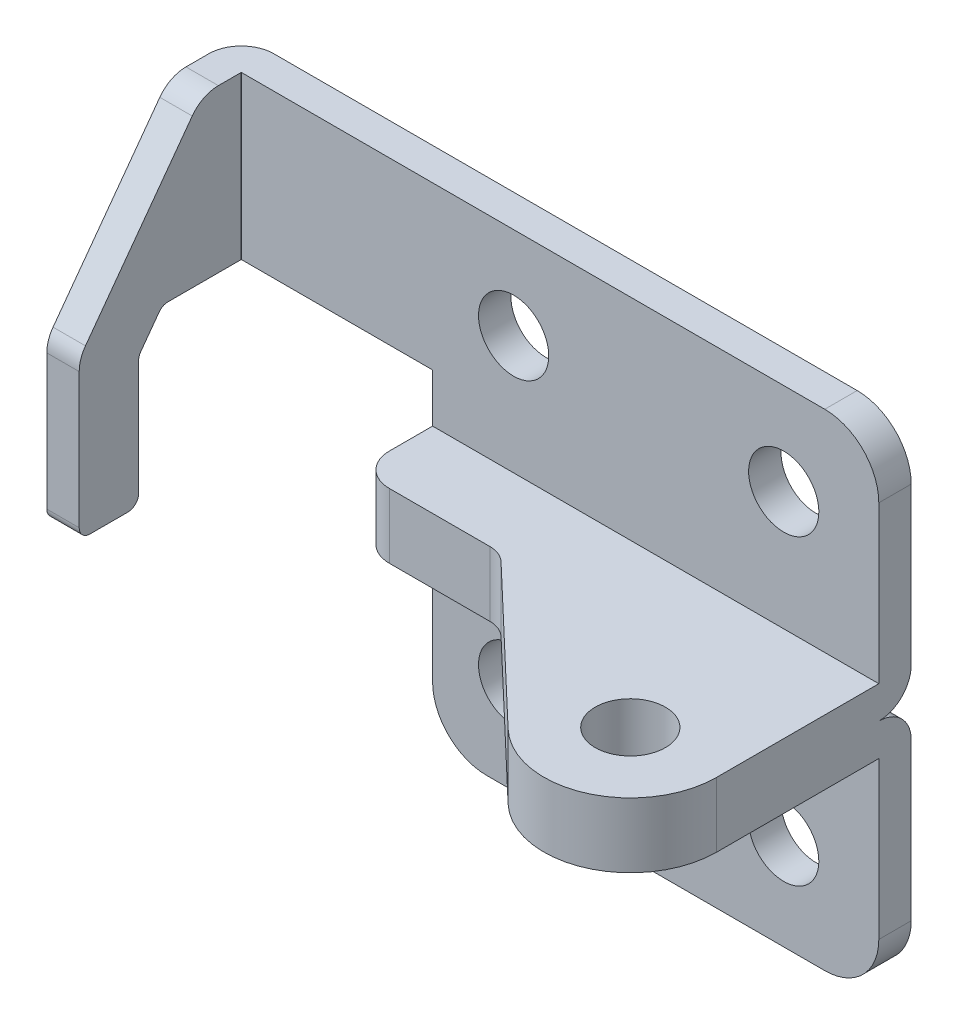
ISO-10303-21;
HEADER;
FILE_DESCRIPTION(('STEP AP214'),'2;1');
FILE_NAME('part.step','',(''),(''),'','','');
FILE_SCHEMA(('AUTOMOTIVE_DESIGN { 1 0 10303 214 1 1 1 1 }'));
ENDSEC;
DATA;
#1=APPLICATION_CONTEXT('core data for automotive mechanical design processes');
#2=APPLICATION_PROTOCOL_DEFINITION('international standard','automotive_design',2000,#1);
#3=PRODUCT_CONTEXT('',#1,'mechanical');
#4=PRODUCT('Part','Part','',(#3));
#5=PRODUCT_RELATED_PRODUCT_CATEGORY('part','',(#4));
#6=PRODUCT_DEFINITION_FORMATION('','',#4);
#7=PRODUCT_DEFINITION_CONTEXT('part definition',#1,'design');
#8=PRODUCT_DEFINITION('design','',#6,#7);
#9=PRODUCT_DEFINITION_SHAPE('','',#8);
#10=(LENGTH_UNIT() NAMED_UNIT(*) SI_UNIT(.MILLI.,.METRE.));
#11=(NAMED_UNIT(*) PLANE_ANGLE_UNIT() SI_UNIT($,.RADIAN.));
#12=(NAMED_UNIT(*) SI_UNIT($,.STERADIAN.) SOLID_ANGLE_UNIT());
#13=UNCERTAINTY_MEASURE_WITH_UNIT(LENGTH_MEASURE(1.E-05),#10,'distance_accuracy_value','');
#14=(GEOMETRIC_REPRESENTATION_CONTEXT(3) GLOBAL_UNCERTAINTY_ASSIGNED_CONTEXT((#13)) GLOBAL_UNIT_ASSIGNED_CONTEXT((#10,
#11,#12)) REPRESENTATION_CONTEXT('',''));
#15=CARTESIAN_POINT('',(0.,0.,0.));
#16=DIRECTION('',(0.,0.,1.));
#17=DIRECTION('',(1.,0.,0.));
#18=AXIS2_PLACEMENT_3D('',#15,#16,#17);
#19=CARTESIAN_POINT('',(-59.0040487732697,-6.50000000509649,35.860243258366));
#20=DIRECTION('',(-1.,0.,0.));
#21=DIRECTION('',(0.,-1.,0.));
#22=AXIS2_PLACEMENT_3D('',#19,#20,#21);
#23=CYLINDRICAL_SURFACE('',#22,1.);
#24=CARTESIAN_POINT('',(-62.0040487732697,-6.50000000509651,35.860243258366));
#25=DIRECTION('',(-1.,0.,0.));
#26=DIRECTION('',(0.,-1.,0.));
#27=AXIS2_PLACEMENT_3D('',#24,#25,#26);
#28=CIRCLE('',#27,1.);
#29=CARTESIAN_POINT('',(-62.0040487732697,-6.5000000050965,36.860243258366));
#30=VERTEX_POINT('',#29);
#31=CARTESIAN_POINT('',(-62.0040487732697,-7.50000000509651,35.860243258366));
#32=VERTEX_POINT('',#31);
#33=EDGE_CURVE('E231',#30,#32,#28,.F.);
#34=ORIENTED_EDGE('',*,*,#33,.T.);
#35=DIRECTION('',(-1.,0.,0.));
#36=VECTOR('',#35,1.);
#37=CARTESIAN_POINT('',(-59.0040487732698,-7.50000000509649,35.860243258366));
#38=LINE('',#37,#36);
#39=CARTESIAN_POINT('',(-59.0040487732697,-7.50000000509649,35.860243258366));
#40=VERTEX_POINT('',#39);
#41=EDGE_CURVE('E229',#32,#40,#38,.F.);
#42=ORIENTED_EDGE('',*,*,#41,.T.);
#43=CARTESIAN_POINT('',(-59.0040487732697,-6.50000000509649,35.860243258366));
#44=DIRECTION('',(-1.,0.,0.));
#45=DIRECTION('',(0.,-1.,0.));
#46=AXIS2_PLACEMENT_3D('',#43,#44,#45);
#47=CIRCLE('',#46,1.);
#48=CARTESIAN_POINT('',(-59.0040487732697,-6.50000000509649,36.860243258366));
#49=VERTEX_POINT('',#48);
#50=EDGE_CURVE('E17',#40,#49,#47,.T.);
#51=ORIENTED_EDGE('',*,*,#50,.T.);
#52=DIRECTION('',(-1.,0.,0.));
#53=VECTOR('',#52,1.);
#54=CARTESIAN_POINT('',(-59.0040487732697,-6.50000000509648,36.860243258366));
#55=LINE('',#54,#53);
#56=EDGE_CURVE('E226',#49,#30,#55,.T.);
#57=ORIENTED_EDGE('',*,*,#56,.T.);
#58=EDGE_LOOP('',(#34,#42,#51,#57));
#59=FACE_BOUND('',#58,.T.);
#60=ADVANCED_FACE('F14',(#59),#23,.T.);
#61=CARTESIAN_POINT('',(-59.0040487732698,-6.50000000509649,32.360243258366));
#62=DIRECTION('',(-1.,0.,0.));
#63=DIRECTION('',(0.,-1.,0.));
#64=AXIS2_PLACEMENT_3D('',#61,#62,#63);
#65=CYLINDRICAL_SURFACE('',#64,1.);
#66=CARTESIAN_POINT('',(-62.0040487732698,-6.50000000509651,32.360243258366));
#67=DIRECTION('',(-1.,0.,0.));
#68=DIRECTION('',(0.,-1.,0.));
#69=AXIS2_PLACEMENT_3D('',#66,#67,#68);
#70=CIRCLE('',#69,1.);
#71=CARTESIAN_POINT('',(-62.0040487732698,-7.50000000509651,32.360243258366));
#72=VERTEX_POINT('',#71);
#73=CARTESIAN_POINT('',(-62.0040487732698,-6.50000000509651,31.360243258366));
#74=VERTEX_POINT('',#73);
#75=EDGE_CURVE('E487',#72,#74,#70,.F.);
#76=ORIENTED_EDGE('',*,*,#75,.T.);
#77=DIRECTION('',(1.,0.,0.));
#78=VECTOR('',#77,1.);
#79=CARTESIAN_POINT('',(-59.0040487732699,-6.50000000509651,31.360243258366));
#80=LINE('',#79,#78);
#81=CARTESIAN_POINT('',(-59.0040487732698,-6.5000000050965,31.360243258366));
#82=VERTEX_POINT('',#81);
#83=EDGE_CURVE('E372',#74,#82,#80,.T.);
#84=ORIENTED_EDGE('',*,*,#83,.T.);
#85=CARTESIAN_POINT('',(-59.0040487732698,-6.50000000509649,32.360243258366));
#86=DIRECTION('',(-1.,0.,0.));
#87=DIRECTION('',(0.,-1.,0.));
#88=AXIS2_PLACEMENT_3D('',#85,#86,#87);
#89=CIRCLE('',#88,1.);
#90=CARTESIAN_POINT('',(-59.0040487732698,-7.50000000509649,32.360243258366));
#91=VERTEX_POINT('',#90);
#92=EDGE_CURVE('E489',#82,#91,#89,.T.);
#93=ORIENTED_EDGE('',*,*,#92,.T.);
#94=DIRECTION('',(-1.,0.,0.));
#95=VECTOR('',#94,1.);
#96=CARTESIAN_POINT('',(-59.0040487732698,-7.50000000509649,32.360243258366));
#97=LINE('',#96,#95);
#98=EDGE_CURVE('E375',#91,#72,#97,.T.);
#99=ORIENTED_EDGE('',*,*,#98,.T.);
#100=EDGE_LOOP('',(#76,#84,#93,#99));
#101=FACE_BOUND('',#100,.T.);
#102=ADVANCED_FACE('F943',(#101),#65,.T.);
#103=CARTESIAN_POINT('',(-59.0040487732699,4.17278437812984,30.3602432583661));
#104=DIRECTION('',(-1.,0.,0.));
#105=DIRECTION('',(0.,-1.,0.));
#106=AXIS2_PLACEMENT_3D('',#103,#104,#105);
#107=CYLINDRICAL_SURFACE('',#106,1.);
#108=CARTESIAN_POINT('',(-59.0040487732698,4.17278437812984,30.3602432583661));
#109=DIRECTION('',(-1.,0.,0.));
#110=DIRECTION('',(0.,-1.,0.));
#111=AXIS2_PLACEMENT_3D('',#108,#109,#110);
#112=CIRCLE('',#111,1.);
#113=CARTESIAN_POINT('',(-59.0040487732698,4.17278437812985,31.360243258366));
#114=VERTEX_POINT('',#113);
#115=CARTESIAN_POINT('',(-59.0040487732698,4.76392242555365,31.1668136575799));
#116=VERTEX_POINT('',#115);
#117=EDGE_CURVE('E400',#114,#116,#112,.T.);
#118=ORIENTED_EDGE('',*,*,#117,.F.);
#119=DIRECTION('',(1.,0.,0.));
#120=VECTOR('',#119,1.);
#121=CARTESIAN_POINT('',(-59.0040487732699,4.17278437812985,31.360243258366));
#122=LINE('',#121,#120);
#123=CARTESIAN_POINT('',(-62.0040487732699,4.17278437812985,31.360243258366));
#124=VERTEX_POINT('',#123);
#125=EDGE_CURVE('E371',#114,#124,#122,.F.);
#126=ORIENTED_EDGE('',*,*,#125,.T.);
#127=CARTESIAN_POINT('',(-62.0040487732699,4.17278437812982,30.3602432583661));
#128=DIRECTION('',(-1.,0.,0.));
#129=DIRECTION('',(0.,-1.,0.));
#130=AXIS2_PLACEMENT_3D('',#127,#128,#129);
#131=CIRCLE('',#130,1.);
#132=CARTESIAN_POINT('',(-62.0040487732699,4.76392242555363,31.1668136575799));
#133=VERTEX_POINT('',#132);
#134=EDGE_CURVE('E485',#133,#124,#131,.F.);
#135=ORIENTED_EDGE('',*,*,#134,.F.);
#136=DIRECTION('',(1.,0.,0.));
#137=VECTOR('',#136,1.);
#138=CARTESIAN_POINT('',(-59.0040487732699,4.76392242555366,31.1668136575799));
#139=LINE('',#138,#137);
#140=EDGE_CURVE('E367',#133,#116,#139,.T.);
#141=ORIENTED_EDGE('',*,*,#140,.T.);
#142=EDGE_LOOP('',(#118,#126,#135,#141));
#143=FACE_BOUND('',#142,.T.);
#144=ADVANCED_FACE('F521',(#143),#107,.F.);
#145=CARTESIAN_POINT('',(-28.99999999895,-1.01915004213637E-13,28.85619448));
#146=DIRECTION('',(0.,0.,-1.));
#147=DIRECTION('',(0.,1.,0.));
#148=AXIS2_PLACEMENT_3D('',#145,#146,#147);
#149=PLANE('',#148);
#150=DIRECTION('',(-1.,0.,0.));
#151=VECTOR('',#150,1.);
#152=CARTESIAN_POINT('',(-8.,3.00000000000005,28.85619448));
#153=LINE('',#152,#151);
#154=CARTESIAN_POINT('',(-38.3,2.99999999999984,28.85619448));
#155=VERTEX_POINT('',#154);
#156=CARTESIAN_POINT('',(-28.99999999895,2.9999999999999,28.85619448));
#157=VERTEX_POINT('',#156);
#158=EDGE_CURVE('E317',#155,#157,#153,.F.);
#159=ORIENTED_EDGE('',*,*,#158,.F.);
#160=DIRECTION('',(0.,-1.,0.));
#161=VECTOR('',#160,1.);
#162=CARTESIAN_POINT('',(-38.3,-1.66901031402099E-13,28.85619448));
#163=LINE('',#162,#161);
#164=CARTESIAN_POINT('',(-38.3,-3.00000000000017,28.85619448));
#165=VERTEX_POINT('',#164);
#166=EDGE_CURVE('E365',#165,#155,#163,.F.);
#167=ORIENTED_EDGE('',*,*,#166,.F.);
#168=DIRECTION('',(-1.,0.,0.));
#169=VECTOR('',#168,1.);
#170=CARTESIAN_POINT('',(-8.,-2.99999999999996,28.85619448));
#171=LINE('',#170,#169);
#172=CARTESIAN_POINT('',(-28.99999999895,-3.0000000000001,28.85619448));
#173=VERTEX_POINT('',#172);
#174=EDGE_CURVE('E327',#165,#173,#171,.F.);
#175=ORIENTED_EDGE('',*,*,#174,.T.);
#176=DIRECTION('',(0.,-1.,0.));
#177=VECTOR('',#176,1.);
#178=CARTESIAN_POINT('',(-28.99999999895,-1.01970090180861E-13,28.85619448));
#179=LINE('',#178,#177);
#180=EDGE_CURVE('E397',#173,#157,#179,.F.);
#181=ORIENTED_EDGE('',*,*,#180,.T.);
#182=EDGE_LOOP('',(#159,#167,#175,#181));
#183=FACE_BOUND('',#182,.T.);
#184=ADVANCED_FACE('F924',(#183),#149,.F.);
#185=CARTESIAN_POINT('',(-28.99999999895,0.,31.35619448));
#186=DIRECTION('',(0.,-1.,0.));
#187=DIRECTION('',(1.,0.,0.));
#188=AXIS2_PLACEMENT_3D('',#185,#186,#187);
#189=CYLINDRICAL_SURFACE('',#188,2.5);
#190=CARTESIAN_POINT('',(-28.99999999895,2.99999999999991,31.35619448));
#191=DIRECTION('',(0.,-1.,0.));
#192=DIRECTION('',(1.,0.,0.));
#193=AXIS2_PLACEMENT_3D('',#190,#191,#192);
#194=CIRCLE('',#193,2.5);
#195=CARTESIAN_POINT('',(-27.2758620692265,2.99999999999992,29.5458496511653));
#196=VERTEX_POINT('',#195);
#197=EDGE_CURVE('E316',#157,#196,#194,.T.);
#198=ORIENTED_EDGE('',*,*,#197,.F.);
#199=ORIENTED_EDGE('',*,*,#180,.F.);
#200=CARTESIAN_POINT('',(-28.99999999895,-3.00000000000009,31.35619448));
#201=DIRECTION('',(0.,-1.,0.));
#202=DIRECTION('',(1.,0.,0.));
#203=AXIS2_PLACEMENT_3D('',#200,#201,#202);
#204=CIRCLE('',#203,2.5);
#205=CARTESIAN_POINT('',(-27.2758620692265,-3.00000000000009,29.5458496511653));
#206=VERTEX_POINT('',#205);
#207=EDGE_CURVE('E326',#173,#206,#204,.T.);
#208=ORIENTED_EDGE('',*,*,#207,.T.);
#209=DIRECTION('',(0.,1.,0.));
#210=VECTOR('',#209,1.);
#211=CARTESIAN_POINT('',(-27.2758620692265,0.,29.5458496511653));
#212=LINE('',#211,#210);
#213=EDGE_CURVE('E384',#206,#196,#212,.T.);
#214=ORIENTED_EDGE('',*,*,#213,.T.);
#215=EDGE_LOOP('',(#198,#199,#208,#214));
#216=FACE_BOUND('',#215,.T.);
#217=ADVANCED_FACE('F914',(#216),#189,.F.);
#218=CARTESIAN_POINT('',(-13.5172413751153,0.,42.6492979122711));
#219=DIRECTION('',(0.689655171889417,0.,-0.724137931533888));
#220=DIRECTION('',(-0.724137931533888,0.,-0.689655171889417));
#221=AXIS2_PLACEMENT_3D('',#218,#219,#220);
#222=PLANE('',#221);
#223=DIRECTION('',(0.724137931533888,0.,0.689655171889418));
#224=VECTOR('',#223,1.);
#225=CARTESIAN_POINT('',(-27.2758620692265,2.99999999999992,29.5458496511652));
#226=LINE('',#225,#224);
#227=CARTESIAN_POINT('',(-13.5172413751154,3.00000000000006,42.6492979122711));
#228=VERTEX_POINT('',#227);
#229=EDGE_CURVE('E313',#196,#228,#226,.T.);
#230=ORIENTED_EDGE('',*,*,#229,.F.);
#231=ORIENTED_EDGE('',*,*,#213,.F.);
#232=DIRECTION('',(0.724137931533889,0.,0.689655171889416));
#233=VECTOR('',#232,1.);
#234=CARTESIAN_POINT('',(-27.2758620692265,-3.00000000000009,29.5458496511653));
#235=LINE('',#234,#233);
#236=CARTESIAN_POINT('',(-13.5172413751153,-2.99999999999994,42.6492979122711));
#237=VERTEX_POINT('',#236);
#238=EDGE_CURVE('E322',#206,#237,#235,.T.);
#239=ORIENTED_EDGE('',*,*,#238,.T.);
#240=DIRECTION('',(0.,-1.,0.));
#241=VECTOR('',#240,1.);
#242=CARTESIAN_POINT('',(-13.5172413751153,0.,42.6492979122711));
#243=LINE('',#242,#241);
#244=EDGE_CURVE('E402',#228,#237,#243,.T.);
#245=ORIENTED_EDGE('',*,*,#244,.F.);
#246=EDGE_LOOP('',(#230,#231,#239,#245));
#247=FACE_BOUND('',#246,.T.);
#248=ADVANCED_FACE('F904',(#247),#222,.F.);
#249=CARTESIAN_POINT('',(-8.,-2.99999999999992,36.85619446));
#250=DIRECTION('',(0.,-1.,0.));
#251=DIRECTION('',(1.,0.,0.));
#252=AXIS2_PLACEMENT_3D('',#249,#250,#251);
#253=CYLINDRICAL_SURFACE('',#252,3.25);
#254=CARTESIAN_POINT('',(-8.,-2.99999999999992,36.85619446));
#255=DIRECTION('',(0.,-1.,0.));
#256=DIRECTION('',(1.,0.,0.));
#257=AXIS2_PLACEMENT_3D('',#254,#255,#256);
#258=CIRCLE('',#257,3.25);
#259=CARTESIAN_POINT('',(-4.75,-2.9999999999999,36.85619446));
#260=VERTEX_POINT('',#259);
#261=EDGE_CURVE('E325',#260,#260,#258,.T.);
#262=ORIENTED_EDGE('',*,*,#261,.T.);
#263=EDGE_LOOP('',(#262));
#264=FACE_BOUND('',#263,.T.);
#265=CARTESIAN_POINT('',(-8.,3.00000000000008,36.85619446));
#266=DIRECTION('',(0.,-1.,0.));
#267=DIRECTION('',(1.,0.,0.));
#268=AXIS2_PLACEMENT_3D('',#265,#266,#267);
#269=CIRCLE('',#268,3.25);
#270=CARTESIAN_POINT('',(-4.75,3.0000000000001,36.85619446));
#271=VERTEX_POINT('',#270);
#272=EDGE_CURVE('E295',#271,#271,#269,.T.);
#273=ORIENTED_EDGE('',*,*,#272,.F.);
#274=EDGE_LOOP('',(#273));
#275=FACE_BOUND('',#274,.T.);
#276=ADVANCED_FACE('F894',(#264,#275),#253,.F.);
#277=CARTESIAN_POINT('',(-41.3,-22.4999999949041,18.8561944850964));
#278=DIRECTION('',(0.,1.,0.));
#279=DIRECTION('',(0.,0.,1.));
#280=AXIS2_PLACEMENT_3D('',#277,#278,#279);
#281=PLANE('',#280);
#282=DIRECTION('',(1.,0.,0.));
#283=VECTOR('',#282,1.);
#284=CARTESIAN_POINT('',(-8.0000000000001,-22.4999999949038,21.8561944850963));
#285=LINE('',#284,#283);
#286=CARTESIAN_POINT('',(-4.99999999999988,-22.4999999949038,21.8561944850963));
#287=VERTEX_POINT('',#286);
#288=CARTESIAN_POINT('',(-36.3,-22.4999999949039,21.8561944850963));
#289=VERTEX_POINT('',#288);
#290=EDGE_CURVE('E264',#287,#289,#285,.F.);
#291=ORIENTED_EDGE('',*,*,#290,.T.);
#292=DIRECTION('',(0.,0.,1.));
#293=VECTOR('',#292,1.);
#294=CARTESIAN_POINT('',(-36.3,-22.4999999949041,18.8561944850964));
#295=LINE('',#294,#293);
#296=CARTESIAN_POINT('',(-36.3,-22.499999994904,18.8561944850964));
#297=VERTEX_POINT('',#296);
#298=EDGE_CURVE('E390',#297,#289,#295,.T.);
#299=ORIENTED_EDGE('',*,*,#298,.F.);
#300=DIRECTION('',(1.,0.,0.));
#301=VECTOR('',#300,1.);
#302=CARTESIAN_POINT('',(-8.0000000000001,-22.4999999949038,18.8561944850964));
#303=LINE('',#302,#301);
#304=CARTESIAN_POINT('',(-4.99999999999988,-22.4999999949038,18.8561944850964));
#305=VERTEX_POINT('',#304);
#306=EDGE_CURVE('E292',#305,#297,#303,.F.);
#307=ORIENTED_EDGE('',*,*,#306,.F.);
#308=DIRECTION('',(0.,0.,1.));
#309=VECTOR('',#308,1.);
#310=CARTESIAN_POINT('',(-4.99999999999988,-22.4999999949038,18.8561944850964));
#311=LINE('',#310,#309);
#312=EDGE_CURVE('E392',#287,#305,#311,.F.);
#313=ORIENTED_EDGE('',*,*,#312,.F.);
#314=EDGE_LOOP('',(#291,#299,#307,#313));
#315=FACE_BOUND('',#314,.T.);
#316=ADVANCED_FACE('F884',(#315),#281,.F.);
#317=CARTESIAN_POINT('',(-8.7999999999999,-13.9999999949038,18.8561944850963));
#318=DIRECTION('',(0.,0.,-1.));
#319=DIRECTION('',(0.,1.,0.));
#320=AXIS2_PLACEMENT_3D('',#317,#318,#319);
#321=CYLINDRICAL_SURFACE('',#320,3.25);
#322=CARTESIAN_POINT('',(-8.7999999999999,-13.9999999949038,21.8561944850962));
#323=DIRECTION('',(0.,0.,-1.));
#324=DIRECTION('',(0.,1.,0.));
#325=AXIS2_PLACEMENT_3D('',#322,#323,#324);
#326=CIRCLE('',#325,3.25);
#327=CARTESIAN_POINT('',(-8.7999999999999,-10.7499999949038,21.8561944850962));
#328=VERTEX_POINT('',#327);
#329=EDGE_CURVE('E456',#328,#328,#326,.F.);
#330=ORIENTED_EDGE('',*,*,#329,.T.);
#331=EDGE_LOOP('',(#330));
#332=FACE_BOUND('',#331,.T.);
#333=CARTESIAN_POINT('',(-8.7999999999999,-13.9999999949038,18.8561944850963));
#334=DIRECTION('',(0.,0.,-1.));
#335=DIRECTION('',(0.,1.,0.));
#336=AXIS2_PLACEMENT_3D('',#333,#334,#335);
#337=CIRCLE('',#336,3.25);
#338=CARTESIAN_POINT('',(-8.7999999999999,-10.7499999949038,18.8561944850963));
#339=VERTEX_POINT('',#338);
#340=EDGE_CURVE('E298',#339,#339,#337,.F.);
#341=ORIENTED_EDGE('',*,*,#340,.F.);
#342=EDGE_LOOP('',(#341));
#343=FACE_BOUND('',#342,.T.);
#344=ADVANCED_FACE('F874',(#332,#343),#321,.F.);
#345=CARTESIAN_POINT('',(-33.8,-13.999999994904,18.8561944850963));
#346=DIRECTION('',(0.,0.,-1.));
#347=DIRECTION('',(0.,1.,0.));
#348=AXIS2_PLACEMENT_3D('',#345,#346,#347);
#349=CYLINDRICAL_SURFACE('',#348,3.25);
#350=CARTESIAN_POINT('',(-33.8,-13.999999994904,21.8561944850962));
#351=DIRECTION('',(0.,0.,-1.));
#352=DIRECTION('',(0.,1.,0.));
#353=AXIS2_PLACEMENT_3D('',#350,#351,#352);
#354=CIRCLE('',#353,3.25);
#355=CARTESIAN_POINT('',(-33.8,-10.749999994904,21.8561944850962));
#356=VERTEX_POINT('',#355);
#357=EDGE_CURVE('E453',#356,#356,#354,.F.);
#358=ORIENTED_EDGE('',*,*,#357,.T.);
#359=EDGE_LOOP('',(#358));
#360=FACE_BOUND('',#359,.T.);
#361=CARTESIAN_POINT('',(-33.8,-13.999999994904,18.8561944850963));
#362=DIRECTION('',(0.,0.,-1.));
#363=DIRECTION('',(0.,1.,0.));
#364=AXIS2_PLACEMENT_3D('',#361,#362,#363);
#365=CIRCLE('',#364,3.25);
#366=CARTESIAN_POINT('',(-33.8,-10.749999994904,18.8561944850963));
#367=VERTEX_POINT('',#366);
#368=EDGE_CURVE('E394',#367,#367,#365,.F.);
#369=ORIENTED_EDGE('',*,*,#368,.F.);
#370=EDGE_LOOP('',(#369));
#371=FACE_BOUND('',#370,.T.);
#372=ADVANCED_FACE('F610',(#360,#371),#349,.F.);
#373=CARTESIAN_POINT('',(-59.0040487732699,7.79176728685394,36.2799544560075));
#374=DIRECTION('',(0.,-0.591138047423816,-0.806570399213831));
#375=DIRECTION('',(0.,0.806570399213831,-0.591138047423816));
#376=AXIS2_PLACEMENT_3D('',#373,#374,#375);
#377=PLANE('',#376);
#378=DIRECTION('',(0.,-0.806570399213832,0.591138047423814));
#379=VECTOR('',#378,1.);
#380=CARTESIAN_POINT('',(-59.00404877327,21.273414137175,26.3992119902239));
#381=LINE('',#380,#379);
#382=CARTESIAN_POINT('',(-59.00404877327,21.273414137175,26.3992119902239));
#383=VERTEX_POINT('',#382);
#384=CARTESIAN_POINT('',(-59.0040487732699,7.79176728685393,36.2799544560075));
#385=VERTEX_POINT('',#384);
#386=EDGE_CURVE('E248',#383,#385,#381,.T.);
#387=ORIENTED_EDGE('',*,*,#386,.F.);
#388=DIRECTION('',(-1.,0.,0.));
#389=VECTOR('',#388,1.);
#390=CARTESIAN_POINT('',(-59.00404877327,21.273414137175,26.3992119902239));
#391=LINE('',#390,#389);
#392=CARTESIAN_POINT('',(-62.00404877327,21.2734141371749,26.3992119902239));
#393=VERTEX_POINT('',#392);
#394=EDGE_CURVE('E385',#393,#383,#391,.F.);
#395=ORIENTED_EDGE('',*,*,#394,.F.);
#396=DIRECTION('',(0.,-0.80657039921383,0.591138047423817));
#397=VECTOR('',#396,1.);
#398=CARTESIAN_POINT('',(-62.00404877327,21.2734141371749,26.3992119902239));
#399=LINE('',#398,#397);
#400=CARTESIAN_POINT('',(-62.0040487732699,7.79176728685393,36.2799544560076));
#401=VERTEX_POINT('',#400);
#402=EDGE_CURVE('E447',#393,#401,#399,.T.);
#403=ORIENTED_EDGE('',*,*,#402,.T.);
#404=DIRECTION('',(-1.,0.,0.));
#405=VECTOR('',#404,1.);
#406=CARTESIAN_POINT('',(-59.0040487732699,7.79176728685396,36.2799544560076));
#407=LINE('',#406,#405);
#408=EDGE_CURVE('E381',#385,#401,#407,.T.);
#409=ORIENTED_EDGE('',*,*,#408,.F.);
#410=EDGE_LOOP('',(#387,#395,#403,#409));
#411=FACE_BOUND('',#410,.T.);
#412=ADVANCED_FACE('F597',(#411),#377,.F.);
#413=CARTESIAN_POINT('',(-59.0040487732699,6.01835314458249,33.860243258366));
#414=DIRECTION('',(-1.,0.,0.));
#415=DIRECTION('',(0.,-1.,0.));
#416=AXIS2_PLACEMENT_3D('',#413,#414,#415);
#417=CYLINDRICAL_SURFACE('',#416,3.);
#418=CARTESIAN_POINT('',(-62.0040487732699,6.01835314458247,33.860243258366));
#419=DIRECTION('',(-1.,0.,0.));
#420=DIRECTION('',(0.,-1.,0.));
#421=AXIS2_PLACEMENT_3D('',#418,#419,#420);
#422=CIRCLE('',#421,3.);
#423=CARTESIAN_POINT('',(-62.0040487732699,6.01835314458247,36.860243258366));
#424=VERTEX_POINT('',#423);
#425=EDGE_CURVE('E444',#401,#424,#422,.F.);
#426=ORIENTED_EDGE('',*,*,#425,.T.);
#427=DIRECTION('',(-1.,0.,0.));
#428=VECTOR('',#427,1.);
#429=CARTESIAN_POINT('',(-59.0040487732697,6.01835314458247,36.860243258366));
#430=LINE('',#429,#428);
#431=CARTESIAN_POINT('',(-59.0040487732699,6.01835314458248,36.860243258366));
#432=VERTEX_POINT('',#431);
#433=EDGE_CURVE('E238',#424,#432,#430,.F.);
#434=ORIENTED_EDGE('',*,*,#433,.T.);
#435=CARTESIAN_POINT('',(-59.0040487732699,6.01835314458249,33.860243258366));
#436=DIRECTION('',(-1.,0.,0.));
#437=DIRECTION('',(0.,-1.,0.));
#438=AXIS2_PLACEMENT_3D('',#435,#436,#437);
#439=CIRCLE('',#438,3.);
#440=EDGE_CURVE('E242',#385,#432,#439,.F.);
#441=ORIENTED_EDGE('',*,*,#440,.F.);
#442=ORIENTED_EDGE('',*,*,#408,.T.);
#443=EDGE_LOOP('',(#426,#434,#441,#442));
#444=FACE_BOUND('',#443,.T.);
#445=ADVANCED_FACE('F600',(#444),#417,.T.);
#446=CARTESIAN_POINT('',(-59.0040487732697,-6.50000000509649,36.860243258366));
#447=DIRECTION('',(0.,0.,-1.));
#448=DIRECTION('',(-1.,0.,0.));
#449=AXIS2_PLACEMENT_3D('',#446,#447,#448);
#450=PLANE('',#449);
#451=DIRECTION('',(0.,1.,0.));
#452=VECTOR('',#451,1.);
#453=CARTESIAN_POINT('',(-59.0040487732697,-14.3561944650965,36.860243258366));
#454=LINE('',#453,#452);
#455=EDGE_CURVE('E235',#432,#49,#454,.F.);
#456=ORIENTED_EDGE('',*,*,#455,.F.);
#457=ORIENTED_EDGE('',*,*,#433,.F.);
#458=DIRECTION('',(0.,1.,0.));
#459=VECTOR('',#458,1.);
#460=CARTESIAN_POINT('',(-62.0040487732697,-14.3561944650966,36.860243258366));
#461=LINE('',#460,#459);
#462=EDGE_CURVE('E237',#424,#30,#461,.F.);
#463=ORIENTED_EDGE('',*,*,#462,.T.);
#464=ORIENTED_EDGE('',*,*,#56,.F.);
#465=EDGE_LOOP('',(#456,#457,#463,#464));
#466=FACE_BOUND('',#465,.T.);
#467=ADVANCED_FACE('F234',(#466),#450,.F.);
#468=CARTESIAN_POINT('',(-59.0040487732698,-7.50000000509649,32.360243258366));
#469=DIRECTION('',(0.,1.,0.));
#470=DIRECTION('',(-1.,0.,0.));
#471=AXIS2_PLACEMENT_3D('',#468,#469,#470);
#472=PLANE('',#471);
#473=DIRECTION('',(0.,0.,1.));
#474=VECTOR('',#473,1.);
#475=CARTESIAN_POINT('',(-59.00404877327,-7.50000000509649,-31.499756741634));
#476=LINE('',#475,#474);
#477=EDGE_CURVE('E244',#40,#91,#476,.F.);
#478=ORIENTED_EDGE('',*,*,#477,.F.);
#479=ORIENTED_EDGE('',*,*,#41,.F.);
#480=DIRECTION('',(0.,0.,1.));
#481=VECTOR('',#480,1.);
#482=CARTESIAN_POINT('',(-62.00404877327,-7.50000000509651,-31.499756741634));
#483=LINE('',#482,#481);
#484=EDGE_CURVE('E496',#32,#72,#483,.F.);
#485=ORIENTED_EDGE('',*,*,#484,.T.);
#486=ORIENTED_EDGE('',*,*,#98,.F.);
#487=EDGE_LOOP('',(#478,#479,#485,#486));
#488=FACE_BOUND('',#487,.T.);
#489=ADVANCED_FACE('F494',(#488),#472,.F.);
#490=CARTESIAN_POINT('',(-59.0040487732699,4.17278437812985,31.360243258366));
#491=DIRECTION('',(0.,0.,1.));
#492=DIRECTION('',(0.,-1.,0.));
#493=AXIS2_PLACEMENT_3D('',#490,#491,#492);
#494=PLANE('',#493);
#495=DIRECTION('',(0.,1.,0.));
#496=VECTOR('',#495,1.);
#497=CARTESIAN_POINT('',(-59.0040487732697,-14.3561944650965,31.360243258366));
#498=LINE('',#497,#496);
#499=EDGE_CURVE('E246',#82,#114,#498,.T.);
#500=ORIENTED_EDGE('',*,*,#499,.F.);
#501=ORIENTED_EDGE('',*,*,#83,.F.);
#502=DIRECTION('',(0.,1.,0.));
#503=VECTOR('',#502,1.);
#504=CARTESIAN_POINT('',(-62.0040487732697,-14.3561944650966,31.360243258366));
#505=LINE('',#504,#503);
#506=EDGE_CURVE('E500',#74,#124,#505,.T.);
#507=ORIENTED_EDGE('',*,*,#506,.T.);
#508=ORIENTED_EDGE('',*,*,#125,.F.);
#509=EDGE_LOOP('',(#500,#501,#507,#508));
#510=FACE_BOUND('',#509,.T.);
#511=ADVANCED_FACE('F519',(#510),#494,.F.);
#512=CARTESIAN_POINT('',(-59.0040487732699,7.09113804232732,29.4611898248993));
#513=DIRECTION('',(0.,0.591138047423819,0.806570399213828));
#514=DIRECTION('',(0.,-0.806570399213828,0.591138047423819));
#515=AXIS2_PLACEMENT_3D('',#512,#513,#514);
#516=PLANE('',#515);
#517=DIRECTION('',(0.,0.806570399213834,-0.591138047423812));
#518=VECTOR('',#517,1.);
#519=CARTESIAN_POINT('',(-59.0040487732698,4.76392242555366,31.1668136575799));
#520=LINE('',#519,#518);
#521=CARTESIAN_POINT('',(-59.0040487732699,7.09113804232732,29.4611898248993));
#522=VERTEX_POINT('',#521);
#523=EDGE_CURVE('E450',#116,#522,#520,.T.);
#524=ORIENTED_EDGE('',*,*,#523,.F.);
#525=ORIENTED_EDGE('',*,*,#140,.F.);
#526=DIRECTION('',(0.,0.806570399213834,-0.591138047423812));
#527=VECTOR('',#526,1.);
#528=CARTESIAN_POINT('',(-62.0040487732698,4.76392242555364,31.1668136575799));
#529=LINE('',#528,#527);
#530=CARTESIAN_POINT('',(-62.0040487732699,7.0911380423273,29.4611898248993));
#531=VERTEX_POINT('',#530);
#532=EDGE_CURVE('E443',#133,#531,#529,.T.);
#533=ORIENTED_EDGE('',*,*,#532,.T.);
#534=DIRECTION('',(-1.,0.,0.));
#535=VECTOR('',#534,1.);
#536=CARTESIAN_POINT('',(-59.0040487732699,7.09113804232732,29.4611898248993));
#537=LINE('',#536,#535);
#538=EDGE_CURVE('E363',#531,#522,#537,.F.);
#539=ORIENTED_EDGE('',*,*,#538,.T.);
#540=EDGE_LOOP('',(#524,#525,#533,#539));
#541=FACE_BOUND('',#540,.T.);
#542=ADVANCED_FACE('F527',(#541),#516,.F.);
#543=CARTESIAN_POINT('',(-58.9940487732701,30.4798553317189,21.8661944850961));
#544=DIRECTION('',(0.,-1.,0.));
#545=DIRECTION('',(1.,0.,0.));
#546=AXIS2_PLACEMENT_3D('',#543,#544,#545);
#547=CYLINDRICAL_SURFACE('',#546,0.00999999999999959);
#548=DIRECTION('',(0.,1.,0.));
#549=VECTOR('',#548,1.);
#550=CARTESIAN_POINT('',(-58.99404877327,-14.3561944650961,21.8561944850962));
#551=LINE('',#550,#549);
#552=CARTESIAN_POINT('',(-58.99404877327,22.4999999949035,21.8561944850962));
#553=VERTEX_POINT('',#552);
#554=CARTESIAN_POINT('',(-58.99404877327,7.4999999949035,21.8561944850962));
#555=VERTEX_POINT('',#554);
#556=EDGE_CURVE('E306',#553,#555,#551,.F.);
#557=ORIENTED_EDGE('',*,*,#556,.F.);
#558=CARTESIAN_POINT('',(-58.99404877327,22.4999999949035,21.8661944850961));
#559=DIRECTION('',(0.,-1.,0.));
#560=DIRECTION('',(1.,0.,0.));
#561=AXIS2_PLACEMENT_3D('',#558,#559,#560);
#562=CIRCLE('',#561,0.00999999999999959);
#563=CARTESIAN_POINT('',(-59.00404877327,22.4999999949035,21.8661944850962));
#564=VERTEX_POINT('',#563);
#565=EDGE_CURVE('E370',#564,#553,#562,.T.);
#566=ORIENTED_EDGE('',*,*,#565,.F.);
#567=DIRECTION('',(0.,1.,0.));
#568=VECTOR('',#567,1.);
#569=CARTESIAN_POINT('',(-59.0040487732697,-14.3561944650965,21.8661944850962));
#570=LINE('',#569,#568);
#571=CARTESIAN_POINT('',(-59.0040487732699,7.4999999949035,21.8661944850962));
#572=VERTEX_POINT('',#571);
#573=EDGE_CURVE('E253',#572,#564,#570,.T.);
#574=ORIENTED_EDGE('',*,*,#573,.F.);
#575=CARTESIAN_POINT('',(-58.9940487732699,7.4999999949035,21.8661944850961));
#576=DIRECTION('',(0.,-1.,0.));
#577=DIRECTION('',(1.,0.,0.));
#578=AXIS2_PLACEMENT_3D('',#575,#576,#577);
#579=CIRCLE('',#578,0.00999999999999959);
#580=EDGE_CURVE('E366',#555,#572,#579,.F.);
#581=ORIENTED_EDGE('',*,*,#580,.F.);
#582=EDGE_LOOP('',(#557,#566,#574,#581));
#583=FACE_BOUND('',#582,.T.);
#584=ADVANCED_FACE('F700',(#583),#547,.F.);
#585=CARTESIAN_POINT('',(-59.0040487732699,6.49999999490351,28.6546194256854));
#586=DIRECTION('',(-1.,0.,0.));
#587=DIRECTION('',(0.,-1.,0.));
#588=AXIS2_PLACEMENT_3D('',#585,#586,#587);
#589=CYLINDRICAL_SURFACE('',#588,1.);
#590=CARTESIAN_POINT('',(-59.0040487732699,6.49999999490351,28.6546194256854));
#591=DIRECTION('',(-1.,0.,0.));
#592=DIRECTION('',(0.,-1.,0.));
#593=AXIS2_PLACEMENT_3D('',#590,#591,#592);
#594=CIRCLE('',#593,1.);
#595=CARTESIAN_POINT('',(-59.0040487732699,7.4999999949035,28.6546194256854));
#596=VERTEX_POINT('',#595);
#597=EDGE_CURVE('E256',#522,#596,#594,.T.);
#598=ORIENTED_EDGE('',*,*,#597,.F.);
#599=ORIENTED_EDGE('',*,*,#538,.F.);
#600=CARTESIAN_POINT('',(-62.0040487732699,6.49999999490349,28.6546194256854));
#601=DIRECTION('',(-1.,0.,0.));
#602=DIRECTION('',(0.,-1.,0.));
#603=AXIS2_PLACEMENT_3D('',#600,#601,#602);
#604=CIRCLE('',#603,1.);
#605=CARTESIAN_POINT('',(-62.0040487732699,7.49999999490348,28.6546194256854));
#606=VERTEX_POINT('',#605);
#607=EDGE_CURVE('E441',#531,#606,#604,.T.);
#608=ORIENTED_EDGE('',*,*,#607,.T.);
#609=DIRECTION('',(-1.,0.,0.));
#610=VECTOR('',#609,1.);
#611=CARTESIAN_POINT('',(-41.3,7.49999999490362,28.6546194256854));
#612=LINE('',#611,#610);
#613=EDGE_CURVE('E358',#606,#596,#612,.F.);
#614=ORIENTED_EDGE('',*,*,#613,.T.);
#615=EDGE_LOOP('',(#598,#599,#608,#614));
#616=FACE_BOUND('',#615,.T.);
#617=ADVANCED_FACE('F532',(#616),#589,.F.);
#618=CARTESIAN_POINT('',(-38.3,-1.77375475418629E-13,25.85619448));
#619=DIRECTION('',(0.,-1.,0.));
#620=DIRECTION('',(1.,0.,0.));
#621=AXIS2_PLACEMENT_3D('',#618,#619,#620);
#622=CYLINDRICAL_SURFACE('',#621,3.);
#623=DIRECTION('',(0.,1.,0.));
#624=VECTOR('',#623,1.);
#625=CARTESIAN_POINT('',(-41.3,3.35619448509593,25.85619448));
#626=LINE('',#625,#624);
#627=CARTESIAN_POINT('',(-41.3,2.99999999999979,25.85619448));
#628=VERTEX_POINT('',#627);
#629=CARTESIAN_POINT('',(-41.3,-3.0000000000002,25.85619448));
#630=VERTEX_POINT('',#629);
#631=EDGE_CURVE('E342',#628,#630,#626,.F.);
#632=ORIENTED_EDGE('',*,*,#631,.T.);
#633=CARTESIAN_POINT('',(-38.3,-3.00000000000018,25.85619448));
#634=DIRECTION('',(0.,-1.,0.));
#635=DIRECTION('',(1.,0.,0.));
#636=AXIS2_PLACEMENT_3D('',#633,#634,#635);
#637=CIRCLE('',#636,3.);
#638=EDGE_CURVE('E330',#630,#165,#637,.F.);
#639=ORIENTED_EDGE('',*,*,#638,.T.);
#640=ORIENTED_EDGE('',*,*,#166,.T.);
#641=CARTESIAN_POINT('',(-38.3,2.99999999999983,25.85619448));
#642=DIRECTION('',(0.,-1.,0.));
#643=DIRECTION('',(1.,0.,0.));
#644=AXIS2_PLACEMENT_3D('',#641,#642,#643);
#645=CIRCLE('',#644,3.);
#646=EDGE_CURVE('E319',#628,#155,#645,.F.);
#647=ORIENTED_EDGE('',*,*,#646,.F.);
#648=EDGE_LOOP('',(#632,#639,#640,#647));
#649=FACE_BOUND('',#648,.T.);
#650=ADVANCED_FACE('F693',(#649),#622,.T.);
#651=CARTESIAN_POINT('',(-36.3,-17.4999999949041,18.8561944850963));
#652=DIRECTION('',(0.,0.,1.));
#653=DIRECTION('',(0.,-1.,0.));
#654=AXIS2_PLACEMENT_3D('',#651,#652,#653);
#655=CYLINDRICAL_SURFACE('',#654,5.);
#656=CARTESIAN_POINT('',(-36.3,-17.4999999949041,18.8561944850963));
#657=DIRECTION('',(0.,0.,1.));
#658=DIRECTION('',(0.,-1.,0.));
#659=AXIS2_PLACEMENT_3D('',#656,#657,#658);
#660=CIRCLE('',#659,5.);
#661=CARTESIAN_POINT('',(-41.3,-17.4999999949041,18.8561944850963));
#662=VERTEX_POINT('',#661);
#663=EDGE_CURVE('E294',#297,#662,#660,.F.);
#664=ORIENTED_EDGE('',*,*,#663,.F.);
#665=ORIENTED_EDGE('',*,*,#298,.T.);
#666=CARTESIAN_POINT('',(-36.3,-17.4999999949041,21.8561944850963));
#667=DIRECTION('',(0.,0.,1.));
#668=DIRECTION('',(0.,-1.,0.));
#669=AXIS2_PLACEMENT_3D('',#666,#667,#668);
#670=CIRCLE('',#669,5.);
#671=CARTESIAN_POINT('',(-41.3,-17.4999999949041,21.8561944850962));
#672=VERTEX_POINT('',#671);
#673=EDGE_CURVE('E267',#289,#672,#670,.F.);
#674=ORIENTED_EDGE('',*,*,#673,.T.);
#675=DIRECTION('',(0.,0.,1.));
#676=VECTOR('',#675,1.);
#677=CARTESIAN_POINT('',(-41.3,-17.4999999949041,18.8561944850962));
#678=LINE('',#677,#676);
#679=EDGE_CURVE('E331',#672,#662,#678,.F.);
#680=ORIENTED_EDGE('',*,*,#679,.T.);
#681=EDGE_LOOP('',(#664,#665,#674,#680));
#682=FACE_BOUND('',#681,.T.);
#683=ADVANCED_FACE('F689',(#682),#655,.T.);
#684=CARTESIAN_POINT('',(-8.,-2.99999999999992,36.85619446));
#685=DIRECTION('',(0.,1.,0.));
#686=DIRECTION('',(-1.,0.,0.));
#687=AXIS2_PLACEMENT_3D('',#684,#685,#686);
#688=PLANE('',#687);
#689=ORIENTED_EDGE('',*,*,#261,.F.);
#690=EDGE_LOOP('',(#689));
#691=FACE_BOUND('',#690,.T.);
#692=DIRECTION('',(0.,0.,1.));
#693=VECTOR('',#692,1.);
#694=CARTESIAN_POINT('',(0.,-2.99999999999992,18.8561944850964));
#695=LINE('',#694,#693);
#696=CARTESIAN_POINT('',(0.,-3.,21.8561944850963));
#697=VERTEX_POINT('',#696);
#698=CARTESIAN_POINT('',(0.,-2.9999999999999,36.85619446));
#699=VERTEX_POINT('',#698);
#700=EDGE_CURVE('E285',#697,#699,#695,.T.);
#701=ORIENTED_EDGE('',*,*,#700,.T.);
#702=CARTESIAN_POINT('',(-8.,-2.99999999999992,36.85619446));
#703=DIRECTION('',(0.,-1.,0.));
#704=DIRECTION('',(1.,0.,0.));
#705=AXIS2_PLACEMENT_3D('',#702,#703,#704);
#706=CIRCLE('',#705,8.);
#707=EDGE_CURVE('E404',#237,#699,#706,.F.);
#708=ORIENTED_EDGE('',*,*,#707,.F.);
#709=ORIENTED_EDGE('',*,*,#238,.F.);
#710=ORIENTED_EDGE('',*,*,#207,.F.);
#711=ORIENTED_EDGE('',*,*,#174,.F.);
#712=ORIENTED_EDGE('',*,*,#638,.F.);
#713=DIRECTION('',(0.,0.,1.));
#714=VECTOR('',#713,1.);
#715=CARTESIAN_POINT('',(-41.3,-3.0000000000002,18.8561944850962));
#716=LINE('',#715,#714);
#717=CARTESIAN_POINT('',(-41.3,-3.00000000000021,21.8561944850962));
#718=VERTEX_POINT('',#717);
#719=EDGE_CURVE('E337',#630,#718,#716,.F.);
#720=ORIENTED_EDGE('',*,*,#719,.T.);
#721=DIRECTION('',(1.,0.,0.));
#722=VECTOR('',#721,1.);
#723=CARTESIAN_POINT('',(-8.0000000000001,-3.00000000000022,21.8561944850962));
#724=LINE('',#723,#722);
#725=EDGE_CURVE('E279',#718,#697,#724,.T.);
#726=ORIENTED_EDGE('',*,*,#725,.T.);
#727=EDGE_LOOP('',(#701,#708,#709,#710,#711,#712,#720,#726));
#728=FACE_BOUND('',#727,.T.);
#729=ADVANCED_FACE('F685',(#691,#728),#688,.F.);
#730=CARTESIAN_POINT('',(-8.,0.,36.85619446));
#731=DIRECTION('',(0.,-1.,0.));
#732=DIRECTION('',(1.,0.,0.));
#733=AXIS2_PLACEMENT_3D('',#730,#731,#732);
#734=CYLINDRICAL_SURFACE('',#733,8.);
#735=ORIENTED_EDGE('',*,*,#244,.T.);
#736=ORIENTED_EDGE('',*,*,#707,.T.);
#737=DIRECTION('',(0.,-1.,0.));
#738=VECTOR('',#737,1.);
#739=CARTESIAN_POINT('',(1.57116660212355E-13,-22.4999999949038,36.85619446));
#740=LINE('',#739,#738);
#741=CARTESIAN_POINT('',(0.,3.00000000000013,36.85619446));
#742=VERTEX_POINT('',#741);
#743=EDGE_CURVE('E288',#699,#742,#740,.F.);
#744=ORIENTED_EDGE('',*,*,#743,.T.);
#745=CARTESIAN_POINT('',(-8.,3.00000000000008,36.85619446));
#746=DIRECTION('',(0.,-1.,0.));
#747=DIRECTION('',(1.,0.,0.));
#748=AXIS2_PLACEMENT_3D('',#745,#746,#747);
#749=CIRCLE('',#748,8.);
#750=EDGE_CURVE('E473',#228,#742,#749,.F.);
#751=ORIENTED_EDGE('',*,*,#750,.F.);
#752=EDGE_LOOP('',(#735,#736,#744,#751));
#753=FACE_BOUND('',#752,.T.);
#754=ADVANCED_FACE('F681',(#753),#734,.T.);
#755=CARTESIAN_POINT('',(-8.,3.00000000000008,36.85619446));
#756=DIRECTION('',(0.,1.,0.));
#757=DIRECTION('',(-1.,0.,0.));
#758=AXIS2_PLACEMENT_3D('',#755,#756,#757);
#759=PLANE('',#758);
#760=ORIENTED_EDGE('',*,*,#272,.T.);
#761=EDGE_LOOP('',(#760));
#762=FACE_BOUND('',#761,.T.);
#763=ORIENTED_EDGE('',*,*,#197,.T.);
#764=ORIENTED_EDGE('',*,*,#229,.T.);
#765=ORIENTED_EDGE('',*,*,#750,.T.);
#766=DIRECTION('',(0.,0.,1.));
#767=VECTOR('',#766,1.);
#768=CARTESIAN_POINT('',(0.,3.00000000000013,18.8561944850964));
#769=LINE('',#768,#767);
#770=CARTESIAN_POINT('',(0.,3.,21.8561944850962));
#771=VERTEX_POINT('',#770);
#772=EDGE_CURVE('E261',#742,#771,#769,.F.);
#773=ORIENTED_EDGE('',*,*,#772,.T.);
#774=DIRECTION('',(1.,0.,0.));
#775=VECTOR('',#774,1.);
#776=CARTESIAN_POINT('',(-7.9999999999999,2.99999999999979,21.8561944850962));
#777=LINE('',#776,#775);
#778=CARTESIAN_POINT('',(-41.3,2.99999999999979,21.8561944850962));
#779=VERTEX_POINT('',#778);
#780=EDGE_CURVE('E302',#779,#771,#777,.T.);
#781=ORIENTED_EDGE('',*,*,#780,.F.);
#782=DIRECTION('',(0.,0.,1.));
#783=VECTOR('',#782,1.);
#784=CARTESIAN_POINT('',(-41.3,2.99999999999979,18.8561944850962));
#785=LINE('',#784,#783);
#786=EDGE_CURVE('E347',#779,#628,#785,.T.);
#787=ORIENTED_EDGE('',*,*,#786,.T.);
#788=ORIENTED_EDGE('',*,*,#646,.T.);
#789=ORIENTED_EDGE('',*,*,#158,.T.);
#790=EDGE_LOOP('',(#763,#764,#765,#773,#781,#787,#788,#789));
#791=FACE_BOUND('',#790,.T.);
#792=ADVANCED_FACE('F677',(#762,#791),#759,.T.);
#793=CARTESIAN_POINT('',(0.,-2.99999999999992,21.8561944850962));
#794=DIRECTION('',(1.,0.,0.));
#795=DIRECTION('',(0.,1.,0.));
#796=AXIS2_PLACEMENT_3D('',#793,#794,#795);
#797=CYLINDRICAL_SURFACE('',#796,3.);
#798=CARTESIAN_POINT('',(0.,-2.99999999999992,21.8561944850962));
#799=DIRECTION('',(1.,0.,0.));
#800=DIRECTION('',(0.,1.,0.));
#801=AXIS2_PLACEMENT_3D('',#798,#799,#800);
#802=CIRCLE('',#801,3.);
#803=CARTESIAN_POINT('',(0.,0.,21.8561944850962));
#804=VERTEX_POINT('',#803);
#805=CARTESIAN_POINT('',(0.,-3.00000000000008,18.8561944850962));
#806=VERTEX_POINT('',#805);
#807=EDGE_CURVE('E422',#804,#806,#802,.F.);
#808=ORIENTED_EDGE('',*,*,#807,.T.);
#809=DIRECTION('',(1.,0.,0.));
#810=VECTOR('',#809,1.);
#811=CARTESIAN_POINT('',(-8.0000000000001,-3.00000000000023,18.8561944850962));
#812=LINE('',#811,#810);
#813=CARTESIAN_POINT('',(-41.3,-3.00000000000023,18.8561944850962));
#814=VERTEX_POINT('',#813);
#815=EDGE_CURVE('E296',#814,#806,#812,.T.);
#816=ORIENTED_EDGE('',*,*,#815,.F.);
#817=CARTESIAN_POINT('',(-41.3,-3.00000000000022,21.8561944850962));
#818=DIRECTION('',(1.,0.,0.));
#819=DIRECTION('',(0.,1.,0.));
#820=AXIS2_PLACEMENT_3D('',#817,#818,#819);
#821=CIRCLE('',#820,3.);
#822=CARTESIAN_POINT('',(-41.3,-2.1163626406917E-13,21.8561944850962));
#823=VERTEX_POINT('',#822);
#824=EDGE_CURVE('E428',#814,#823,#821,.T.);
#825=ORIENTED_EDGE('',*,*,#824,.T.);
#826=DIRECTION('',(-1.,0.,0.));
#827=VECTOR('',#826,1.);
#828=CARTESIAN_POINT('',(-41.3,-2.09901540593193E-13,21.8561944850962));
#829=LINE('',#828,#827);
#830=EDGE_CURVE('E299',#804,#823,#829,.T.);
#831=ORIENTED_EDGE('',*,*,#830,.F.);
#832=EDGE_LOOP('',(#808,#816,#825,#831));
#833=FACE_BOUND('',#832,.T.);
#834=ADVANCED_FACE('F673',(#833),#797,.T.);
#835=CARTESIAN_POINT('',(-8.0000000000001,14.3561944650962,18.8561944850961));
#836=DIRECTION('',(0.,0.,-1.));
#837=DIRECTION('',(0.,1.,0.));
#838=AXIS2_PLACEMENT_3D('',#835,#836,#837);
#839=PLANE('',#838);
#840=ORIENTED_EDGE('',*,*,#368,.T.);
#841=EDGE_LOOP('',(#840));
#842=FACE_BOUND('',#841,.T.);
#843=ORIENTED_EDGE('',*,*,#340,.T.);
#844=EDGE_LOOP('',(#843));
#845=FACE_BOUND('',#844,.T.);
#846=DIRECTION('',(0.,-1.,0.));
#847=VECTOR('',#846,1.);
#848=CARTESIAN_POINT('',(1.57116660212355E-13,-22.4999999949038,18.8561944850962));
#849=LINE('',#848,#847);
#850=CARTESIAN_POINT('',(1.22249925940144E-13,-17.4999999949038,18.8561944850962));
#851=VERTEX_POINT('',#850);
#852=EDGE_CURVE('E273',#806,#851,#849,.T.);
#853=ORIENTED_EDGE('',*,*,#852,.T.);
#854=CARTESIAN_POINT('',(-4.99999999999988,-17.4999999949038,18.8561944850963));
#855=DIRECTION('',(0.,0.,1.));
#856=DIRECTION('',(0.,-1.,0.));
#857=AXIS2_PLACEMENT_3D('',#854,#855,#856);
#858=CIRCLE('',#857,5.);
#859=EDGE_CURVE('E282',#305,#851,#858,.T.);
#860=ORIENTED_EDGE('',*,*,#859,.F.);
#861=ORIENTED_EDGE('',*,*,#306,.T.);
#862=ORIENTED_EDGE('',*,*,#663,.T.);
#863=DIRECTION('',(0.,1.,0.));
#864=VECTOR('',#863,1.);
#865=CARTESIAN_POINT('',(-41.3,3.35619448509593,18.8561944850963));
#866=LINE('',#865,#864);
#867=EDGE_CURVE('E301',#662,#814,#866,.T.);
#868=ORIENTED_EDGE('',*,*,#867,.T.);
#869=ORIENTED_EDGE('',*,*,#815,.T.);
#870=EDGE_LOOP('',(#853,#860,#861,#862,#868,#869));
#871=FACE_BOUND('',#870,.T.);
#872=ADVANCED_FACE('F669',(#842,#845,#871),#839,.T.);
#873=CARTESIAN_POINT('',(-4.99999999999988,-17.4999999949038,18.8561944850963));
#874=DIRECTION('',(0.,0.,1.));
#875=DIRECTION('',(0.,-1.,0.));
#876=AXIS2_PLACEMENT_3D('',#873,#874,#875);
#877=CYLINDRICAL_SURFACE('',#876,5.);
#878=ORIENTED_EDGE('',*,*,#859,.T.);
#879=DIRECTION('',(0.,0.,1.));
#880=VECTOR('',#879,1.);
#881=CARTESIAN_POINT('',(1.22201846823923E-13,-17.4999999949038,18.8561944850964));
#882=LINE('',#881,#880);
#883=CARTESIAN_POINT('',(1.22249925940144E-13,-17.4999999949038,21.8561944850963));
#884=VERTEX_POINT('',#883);
#885=EDGE_CURVE('E269',#851,#884,#882,.T.);
#886=ORIENTED_EDGE('',*,*,#885,.T.);
#887=CARTESIAN_POINT('',(-4.99999999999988,-17.4999999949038,21.8561944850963));
#888=DIRECTION('',(0.,0.,1.));
#889=DIRECTION('',(0.,-1.,0.));
#890=AXIS2_PLACEMENT_3D('',#887,#888,#889);
#891=CIRCLE('',#890,5.);
#892=EDGE_CURVE('E268',#884,#287,#891,.F.);
#893=ORIENTED_EDGE('',*,*,#892,.T.);
#894=ORIENTED_EDGE('',*,*,#312,.T.);
#895=EDGE_LOOP('',(#878,#886,#893,#894));
#896=FACE_BOUND('',#895,.T.);
#897=ADVANCED_FACE('F665',(#896),#877,.T.);
#898=CARTESIAN_POINT('',(-8.0000000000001,14.3561944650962,21.8561944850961));
#899=DIRECTION('',(0.,0.,-1.));
#900=DIRECTION('',(0.,1.,0.));
#901=AXIS2_PLACEMENT_3D('',#898,#899,#900);
#902=PLANE('',#901);
#903=ORIENTED_EDGE('',*,*,#357,.F.);
#904=EDGE_LOOP('',(#903));
#905=FACE_BOUND('',#904,.T.);
#906=ORIENTED_EDGE('',*,*,#329,.F.);
#907=EDGE_LOOP('',(#906));
#908=FACE_BOUND('',#907,.T.);
#909=ORIENTED_EDGE('',*,*,#673,.F.);
#910=ORIENTED_EDGE('',*,*,#290,.F.);
#911=ORIENTED_EDGE('',*,*,#892,.F.);
#912=DIRECTION('',(0.,-1.,0.));
#913=VECTOR('',#912,1.);
#914=CARTESIAN_POINT('',(1.57116660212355E-13,-22.4999999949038,21.8561944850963));
#915=LINE('',#914,#913);
#916=EDGE_CURVE('E272',#884,#697,#915,.F.);
#917=ORIENTED_EDGE('',*,*,#916,.T.);
#918=ORIENTED_EDGE('',*,*,#725,.F.);
#919=DIRECTION('',(0.,1.,0.));
#920=VECTOR('',#919,1.);
#921=CARTESIAN_POINT('',(-41.3,3.35619448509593,21.8561944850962));
#922=LINE('',#921,#920);
#923=EDGE_CURVE('E334',#718,#672,#922,.F.);
#924=ORIENTED_EDGE('',*,*,#923,.T.);
#925=EDGE_LOOP('',(#909,#910,#911,#917,#918,#924));
#926=FACE_BOUND('',#925,.T.);
#927=ADVANCED_FACE('F662',(#905,#908,#926),#902,.F.);
#928=CARTESIAN_POINT('',(-59.0040487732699,-14.3561944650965,-31.499756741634));
#929=DIRECTION('',(1.,0.,0.));
#930=DIRECTION('',(0.,1.,0.));
#931=AXIS2_PLACEMENT_3D('',#928,#929,#930);
#932=PLANE('',#931);
#933=ORIENTED_EDGE('',*,*,#117,.T.);
#934=ORIENTED_EDGE('',*,*,#523,.T.);
#935=ORIENTED_EDGE('',*,*,#597,.T.);
#936=DIRECTION('',(0.,0.,1.));
#937=VECTOR('',#936,1.);
#938=CARTESIAN_POINT('',(-59.0040487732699,7.4999999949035,21.8561944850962));
#939=LINE('',#938,#937);
#940=EDGE_CURVE('E361',#596,#572,#939,.F.);
#941=ORIENTED_EDGE('',*,*,#940,.T.);
#942=ORIENTED_EDGE('',*,*,#573,.T.);
#943=DIRECTION('',(0.,0.,1.));
#944=VECTOR('',#943,1.);
#945=CARTESIAN_POINT('',(-59.00404877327,22.4999999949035,21.8561944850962));
#946=LINE('',#945,#944);
#947=CARTESIAN_POINT('',(-59.00404877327,22.4999999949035,23.9795007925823));
#948=VERTEX_POINT('',#947);
#949=EDGE_CURVE('E512',#564,#948,#946,.T.);
#950=ORIENTED_EDGE('',*,*,#949,.T.);
#951=CARTESIAN_POINT('',(-59.00404877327,19.4999999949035,23.9795007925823));
#952=DIRECTION('',(-1.,0.,0.));
#953=DIRECTION('',(0.,-1.,0.));
#954=AXIS2_PLACEMENT_3D('',#951,#952,#953);
#955=CIRCLE('',#954,3.);
#956=EDGE_CURVE('E389',#383,#948,#955,.T.);
#957=ORIENTED_EDGE('',*,*,#956,.F.);
#958=ORIENTED_EDGE('',*,*,#386,.T.);
#959=ORIENTED_EDGE('',*,*,#440,.T.);
#960=ORIENTED_EDGE('',*,*,#455,.T.);
#961=ORIENTED_EDGE('',*,*,#50,.F.);
#962=ORIENTED_EDGE('',*,*,#477,.T.);
#963=ORIENTED_EDGE('',*,*,#92,.F.);
#964=ORIENTED_EDGE('',*,*,#499,.T.);
#965=EDGE_LOOP('',(#933,#934,#935,#941,#942,#950,#957,#958,#959,#960,#961,#962,#963,#964));
#966=FACE_BOUND('',#965,.T.);
#967=ADVANCED_FACE('F240',(#966),#932,.T.);
#968=CARTESIAN_POINT('',(-59.00404877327,19.4999999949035,23.9795007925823));
#969=DIRECTION('',(-1.,0.,0.));
#970=DIRECTION('',(0.,-1.,0.));
#971=AXIS2_PLACEMENT_3D('',#968,#969,#970);
#972=CYLINDRICAL_SURFACE('',#971,3.);
#973=CARTESIAN_POINT('',(-62.00404877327,19.4999999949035,23.9795007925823));
#974=DIRECTION('',(-1.,0.,0.));
#975=DIRECTION('',(0.,-1.,0.));
#976=AXIS2_PLACEMENT_3D('',#973,#974,#975);
#977=CIRCLE('',#976,3.);
#978=CARTESIAN_POINT('',(-62.00404877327,22.4999999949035,23.9795007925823));
#979=VERTEX_POINT('',#978);
#980=EDGE_CURVE('E388',#979,#393,#977,.F.);
#981=ORIENTED_EDGE('',*,*,#980,.T.);
#982=ORIENTED_EDGE('',*,*,#394,.T.);
#983=ORIENTED_EDGE('',*,*,#956,.T.);
#984=DIRECTION('',(1.,0.,0.));
#985=VECTOR('',#984,1.);
#986=CARTESIAN_POINT('',(-63.4792575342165,22.4999999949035,23.9795007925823));
#987=LINE('',#986,#985);
#988=EDGE_CURVE('E509',#948,#979,#987,.F.);
#989=ORIENTED_EDGE('',*,*,#988,.T.);
#990=EDGE_LOOP('',(#981,#982,#983,#989));
#991=FACE_BOUND('',#990,.T.);
#992=ADVANCED_FACE('F594',(#991),#972,.T.);
#993=CARTESIAN_POINT('',(-62.0040487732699,-14.3561944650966,-31.499756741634));
#994=DIRECTION('',(1.,0.,0.));
#995=DIRECTION('',(0.,1.,0.));
#996=AXIS2_PLACEMENT_3D('',#993,#994,#995);
#997=PLANE('',#996);
#998=DIRECTION('',(0.,0.,1.));
#999=VECTOR('',#998,1.);
#1000=CARTESIAN_POINT('',(-62.0040487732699,7.49999999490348,21.8561944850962));
#1001=LINE('',#1000,#999);
#1002=CARTESIAN_POINT('',(-62.0040487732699,7.49999999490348,21.8661944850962));
#1003=VERTEX_POINT('',#1002);
#1004=EDGE_CURVE('E362',#1003,#606,#1001,.T.);
#1005=ORIENTED_EDGE('',*,*,#1004,.T.);
#1006=ORIENTED_EDGE('',*,*,#607,.F.);
#1007=ORIENTED_EDGE('',*,*,#532,.F.);
#1008=ORIENTED_EDGE('',*,*,#134,.T.);
#1009=ORIENTED_EDGE('',*,*,#506,.F.);
#1010=ORIENTED_EDGE('',*,*,#75,.F.);
#1011=ORIENTED_EDGE('',*,*,#484,.F.);
#1012=ORIENTED_EDGE('',*,*,#33,.F.);
#1013=ORIENTED_EDGE('',*,*,#462,.F.);
#1014=ORIENTED_EDGE('',*,*,#425,.F.);
#1015=ORIENTED_EDGE('',*,*,#402,.F.);
#1016=ORIENTED_EDGE('',*,*,#980,.F.);
#1017=DIRECTION('',(0.,0.,1.));
#1018=VECTOR('',#1017,1.);
#1019=CARTESIAN_POINT('',(-62.00404877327,22.4999999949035,21.8561944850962));
#1020=LINE('',#1019,#1018);
#1021=CARTESIAN_POINT('',(-62.00404877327,22.4999999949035,21.8661944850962));
#1022=VERTEX_POINT('',#1021);
#1023=EDGE_CURVE('E419',#979,#1022,#1020,.F.);
#1024=ORIENTED_EDGE('',*,*,#1023,.T.);
#1025=DIRECTION('',(0.,-1.,0.));
#1026=VECTOR('',#1025,1.);
#1027=CARTESIAN_POINT('',(-62.0040487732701,30.4798553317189,21.8661944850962));
#1028=LINE('',#1027,#1026);
#1029=EDGE_CURVE('E435',#1003,#1022,#1028,.F.);
#1030=ORIENTED_EDGE('',*,*,#1029,.F.);
#1031=EDGE_LOOP('',(#1005,#1006,#1007,#1008,#1009,#1010,#1011,#1012,#1013,#1014,#1015,#1016,
#1024,#1030));
#1032=FACE_BOUND('',#1031,.T.);
#1033=ADVANCED_FACE('F498',(#1032),#997,.F.);
#1034=CARTESIAN_POINT('',(-7.9999999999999,-14.3561944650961,21.8561944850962));
#1035=DIRECTION('',(0.,0.,1.));
#1036=DIRECTION('',(1.,0.,0.));
#1037=AXIS2_PLACEMENT_3D('',#1034,#1035,#1036);
#1038=PLANE('',#1037);
#1039=CARTESIAN_POINT('',(-8.8,13.9999999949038,21.8561944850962));
#1040=DIRECTION('',(0.,0.,1.));
#1041=DIRECTION('',(0.,-1.,0.));
#1042=AXIS2_PLACEMENT_3D('',#1039,#1040,#1041);
#1043=CIRCLE('',#1042,3.25);
#1044=CARTESIAN_POINT('',(-8.8,10.7499999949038,21.8561944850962));
#1045=VERTEX_POINT('',#1044);
#1046=EDGE_CURVE('E436',#1045,#1045,#1043,.F.);
#1047=ORIENTED_EDGE('',*,*,#1046,.T.);
#1048=EDGE_LOOP('',(#1047));
#1049=FACE_BOUND('',#1048,.T.);
#1050=CARTESIAN_POINT('',(-33.8,13.9999999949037,21.8561944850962));
#1051=DIRECTION('',(0.,0.,1.));
#1052=DIRECTION('',(0.,-1.,0.));
#1053=AXIS2_PLACEMENT_3D('',#1050,#1051,#1052);
#1054=CIRCLE('',#1053,3.25);
#1055=CARTESIAN_POINT('',(-33.8,10.7499999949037,21.8561944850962));
#1056=VERTEX_POINT('',#1055);
#1057=EDGE_CURVE('E305',#1056,#1056,#1054,.F.);
#1058=ORIENTED_EDGE('',*,*,#1057,.T.);
#1059=EDGE_LOOP('',(#1058));
#1060=FACE_BOUND('',#1059,.T.);
#1061=DIRECTION('',(0.,1.,0.));
#1062=VECTOR('',#1061,1.);
#1063=CARTESIAN_POINT('',(-41.3,3.35619448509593,21.8561944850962));
#1064=LINE('',#1063,#1062);
#1065=CARTESIAN_POINT('',(-41.3,7.49999999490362,21.8561944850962));
#1066=VERTEX_POINT('',#1065);
#1067=EDGE_CURVE('E350',#1066,#779,#1064,.F.);
#1068=ORIENTED_EDGE('',*,*,#1067,.T.);
#1069=ORIENTED_EDGE('',*,*,#780,.T.);
#1070=DIRECTION('',(0.,-1.,0.));
#1071=VECTOR('',#1070,1.);
#1072=CARTESIAN_POINT('',(1.57116660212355E-13,-22.4999999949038,21.8561944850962));
#1073=LINE('',#1072,#1071);
#1074=CARTESIAN_POINT('',(-1.20563281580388E-13,17.4999999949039,21.8561944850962));
#1075=VERTEX_POINT('',#1074);
#1076=EDGE_CURVE('E257',#771,#1075,#1073,.F.);
#1077=ORIENTED_EDGE('',*,*,#1076,.T.);
#1078=CARTESIAN_POINT('',(-5.00000000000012,17.4999999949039,21.8561944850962));
#1079=DIRECTION('',(0.,0.,-1.));
#1080=DIRECTION('',(-1.,0.,0.));
#1081=AXIS2_PLACEMENT_3D('',#1078,#1079,#1080);
#1082=CIRCLE('',#1081,5.);
#1083=CARTESIAN_POINT('',(-5.00000000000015,22.4999999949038,21.8561944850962));
#1084=VERTEX_POINT('',#1083);
#1085=EDGE_CURVE('E276',#1084,#1075,#1082,.T.);
#1086=ORIENTED_EDGE('',*,*,#1085,.F.);
#1087=DIRECTION('',(1.,0.,0.));
#1088=VECTOR('',#1087,1.);
#1089=CARTESIAN_POINT('',(-63.4792575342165,22.4999999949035,21.8561944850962));
#1090=LINE('',#1089,#1088);
#1091=EDGE_CURVE('E415',#1084,#553,#1090,.F.);
#1092=ORIENTED_EDGE('',*,*,#1091,.T.);
#1093=ORIENTED_EDGE('',*,*,#556,.T.);
#1094=DIRECTION('',(-1.,0.,0.));
#1095=VECTOR('',#1094,1.);
#1096=CARTESIAN_POINT('',(-41.3,7.49999999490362,21.8561944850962));
#1097=LINE('',#1096,#1095);
#1098=EDGE_CURVE('E431',#555,#1066,#1097,.F.);
#1099=ORIENTED_EDGE('',*,*,#1098,.T.);
#1100=EDGE_LOOP('',(#1068,#1069,#1077,#1086,#1092,#1093,#1099));
#1101=FACE_BOUND('',#1100,.T.);
#1102=ADVANCED_FACE('F651',(#1049,#1060,#1101),#1038,.T.);
#1103=CARTESIAN_POINT('',(-33.8,13.9999999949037,21.8561944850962));
#1104=DIRECTION('',(0.,0.,1.));
#1105=DIRECTION('',(0.,-1.,0.));
#1106=AXIS2_PLACEMENT_3D('',#1103,#1104,#1105);
#1107=CYLINDRICAL_SURFACE('',#1106,3.25);
#1108=CARTESIAN_POINT('',(-33.8,13.9999999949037,18.8561944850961));
#1109=DIRECTION('',(0.,0.,1.));
#1110=DIRECTION('',(0.,-1.,0.));
#1111=AXIS2_PLACEMENT_3D('',#1108,#1109,#1110);
#1112=CIRCLE('',#1111,3.25);
#1113=CARTESIAN_POINT('',(-33.8,10.7499999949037,18.8561944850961));
#1114=VERTEX_POINT('',#1113);
#1115=EDGE_CURVE('E412',#1114,#1114,#1112,.F.);
#1116=ORIENTED_EDGE('',*,*,#1115,.T.);
#1117=EDGE_LOOP('',(#1116));
#1118=FACE_BOUND('',#1117,.T.);
#1119=ORIENTED_EDGE('',*,*,#1057,.F.);
#1120=EDGE_LOOP('',(#1119));
#1121=FACE_BOUND('',#1120,.T.);
#1122=ADVANCED_FACE('F647',(#1118,#1121),#1107,.F.);
#1123=CARTESIAN_POINT('',(-8.8,13.9999999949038,21.8561944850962));
#1124=DIRECTION('',(0.,0.,1.));
#1125=DIRECTION('',(0.,-1.,0.));
#1126=AXIS2_PLACEMENT_3D('',#1123,#1124,#1125);
#1127=CYLINDRICAL_SURFACE('',#1126,3.25);
#1128=CARTESIAN_POINT('',(-8.8,13.9999999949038,18.8561944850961));
#1129=DIRECTION('',(0.,0.,1.));
#1130=DIRECTION('',(0.,-1.,0.));
#1131=AXIS2_PLACEMENT_3D('',#1128,#1129,#1130);
#1132=CIRCLE('',#1131,3.25);
#1133=CARTESIAN_POINT('',(-8.8,10.7499999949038,18.8561944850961));
#1134=VERTEX_POINT('',#1133);
#1135=EDGE_CURVE('E408',#1134,#1134,#1132,.F.);
#1136=ORIENTED_EDGE('',*,*,#1135,.T.);
#1137=EDGE_LOOP('',(#1136));
#1138=FACE_BOUND('',#1137,.T.);
#1139=ORIENTED_EDGE('',*,*,#1046,.F.);
#1140=EDGE_LOOP('',(#1139));
#1141=FACE_BOUND('',#1140,.T.);
#1142=ADVANCED_FACE('F644',(#1138,#1141),#1127,.F.);
#1143=CARTESIAN_POINT('',(-58.9940487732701,30.4798553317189,21.8661944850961));
#1144=DIRECTION('',(0.,-1.,0.));
#1145=DIRECTION('',(1.,0.,0.));
#1146=AXIS2_PLACEMENT_3D('',#1143,#1144,#1145);
#1147=CYLINDRICAL_SURFACE('',#1146,3.01);
#1148=ORIENTED_EDGE('',*,*,#1029,.T.);
#1149=CARTESIAN_POINT('',(-58.99404877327,22.4999999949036,21.8661944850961));
#1150=DIRECTION('',(0.,-1.,0.));
#1151=DIRECTION('',(1.,0.,0.));
#1152=AXIS2_PLACEMENT_3D('',#1149,#1150,#1151);
#1153=CIRCLE('',#1152,3.01);
#1154=CARTESIAN_POINT('',(-58.99404877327,22.4999999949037,18.8561944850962));
#1155=VERTEX_POINT('',#1154);
#1156=EDGE_CURVE('E416',#1022,#1155,#1153,.T.);
#1157=ORIENTED_EDGE('',*,*,#1156,.T.);
#1158=DIRECTION('',(0.,1.,0.));
#1159=VECTOR('',#1158,1.);
#1160=CARTESIAN_POINT('',(-58.99404877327,-14.3561944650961,18.8561944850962));
#1161=LINE('',#1160,#1159);
#1162=CARTESIAN_POINT('',(-58.99404877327,7.4999999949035,18.8561944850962));
#1163=VERTEX_POINT('',#1162);
#1164=EDGE_CURVE('E411',#1155,#1163,#1161,.F.);
#1165=ORIENTED_EDGE('',*,*,#1164,.T.);
#1166=CARTESIAN_POINT('',(-58.9940487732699,7.4999999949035,21.8661944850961));
#1167=DIRECTION('',(0.,-1.,0.));
#1168=DIRECTION('',(1.,0.,0.));
#1169=AXIS2_PLACEMENT_3D('',#1166,#1167,#1168);
#1170=CIRCLE('',#1169,3.01);
#1171=EDGE_CURVE('E432',#1163,#1003,#1170,.F.);
#1172=ORIENTED_EDGE('',*,*,#1171,.T.);
#1173=EDGE_LOOP('',(#1148,#1157,#1165,#1172));
#1174=FACE_BOUND('',#1173,.T.);
#1175=ADVANCED_FACE('F548',(#1174),#1147,.T.);
#1176=CARTESIAN_POINT('',(-41.3,7.49999999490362,21.8561944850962));
#1177=DIRECTION('',(0.,1.,0.));
#1178=DIRECTION('',(-1.,0.,0.));
#1179=AXIS2_PLACEMENT_3D('',#1176,#1177,#1178);
#1180=PLANE('',#1179);
#1181=DIRECTION('',(0.,0.,1.));
#1182=VECTOR('',#1181,1.);
#1183=CARTESIAN_POINT('',(-41.3,7.49999999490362,18.8561944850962));
#1184=LINE('',#1183,#1182);
#1185=CARTESIAN_POINT('',(-41.3,7.49999999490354,18.8561944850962));
#1186=VERTEX_POINT('',#1185);
#1187=EDGE_CURVE('E355',#1186,#1066,#1184,.T.);
#1188=ORIENTED_EDGE('',*,*,#1187,.T.);
#1189=ORIENTED_EDGE('',*,*,#1098,.F.);
#1190=ORIENTED_EDGE('',*,*,#580,.T.);
#1191=ORIENTED_EDGE('',*,*,#940,.F.);
#1192=ORIENTED_EDGE('',*,*,#613,.F.);
#1193=ORIENTED_EDGE('',*,*,#1004,.F.);
#1194=ORIENTED_EDGE('',*,*,#1171,.F.);
#1195=DIRECTION('',(1.,0.,0.));
#1196=VECTOR('',#1195,1.);
#1197=CARTESIAN_POINT('',(-7.9999999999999,7.4999999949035,18.8561944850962));
#1198=LINE('',#1197,#1196);
#1199=EDGE_CURVE('E562',#1163,#1186,#1198,.T.);
#1200=ORIENTED_EDGE('',*,*,#1199,.T.);
#1201=EDGE_LOOP('',(#1188,#1189,#1190,#1191,#1192,#1193,#1194,#1200));
#1202=FACE_BOUND('',#1201,.T.);
#1203=ADVANCED_FACE('F538',(#1202),#1180,.F.);
#1204=CARTESIAN_POINT('',(-41.3,3.35619448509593,18.8561944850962));
#1205=DIRECTION('',(1.,0.,0.));
#1206=DIRECTION('',(0.,1.,0.));
#1207=AXIS2_PLACEMENT_3D('',#1204,#1205,#1206);
#1208=PLANE('',#1207);
#1209=ORIENTED_EDGE('',*,*,#679,.F.);
#1210=ORIENTED_EDGE('',*,*,#923,.F.);
#1211=ORIENTED_EDGE('',*,*,#719,.F.);
#1212=ORIENTED_EDGE('',*,*,#631,.F.);
#1213=ORIENTED_EDGE('',*,*,#786,.F.);
#1214=ORIENTED_EDGE('',*,*,#1067,.F.);
#1215=ORIENTED_EDGE('',*,*,#1187,.F.);
#1216=DIRECTION('',(0.,1.,0.));
#1217=VECTOR('',#1216,1.);
#1218=CARTESIAN_POINT('',(-41.3,-14.3561944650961,18.8561944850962));
#1219=LINE('',#1218,#1217);
#1220=CARTESIAN_POINT('',(-41.3,2.99999999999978,18.8561944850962));
#1221=VERTEX_POINT('',#1220);
#1222=EDGE_CURVE('E569',#1186,#1221,#1219,.F.);
#1223=ORIENTED_EDGE('',*,*,#1222,.T.);
#1224=CARTESIAN_POINT('',(-41.3,2.99999999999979,21.8561944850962));
#1225=DIRECTION('',(-1.,0.,0.));
#1226=DIRECTION('',(0.,-1.,0.));
#1227=AXIS2_PLACEMENT_3D('',#1224,#1225,#1226);
#1228=CIRCLE('',#1227,3.);
#1229=EDGE_CURVE('E289',#823,#1221,#1228,.F.);
#1230=ORIENTED_EDGE('',*,*,#1229,.F.);
#1231=ORIENTED_EDGE('',*,*,#824,.F.);
#1232=ORIENTED_EDGE('',*,*,#867,.F.);
#1233=EDGE_LOOP('',(#1209,#1210,#1211,#1212,#1213,#1214,#1215,#1223,#1230,#1231,#1232));
#1234=FACE_BOUND('',#1233,.T.);
#1235=ADVANCED_FACE('F635',(#1234),#1208,.F.);
#1236=CARTESIAN_POINT('',(-41.3,2.99999999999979,21.8561944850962));
#1237=DIRECTION('',(-1.,0.,0.));
#1238=DIRECTION('',(0.,-1.,0.));
#1239=AXIS2_PLACEMENT_3D('',#1236,#1237,#1238);
#1240=CYLINDRICAL_SURFACE('',#1239,3.);
#1241=ORIENTED_EDGE('',*,*,#1229,.T.);
#1242=DIRECTION('',(1.,0.,0.));
#1243=VECTOR('',#1242,1.);
#1244=CARTESIAN_POINT('',(-7.9999999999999,2.99999999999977,18.8561944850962));
#1245=LINE('',#1244,#1243);
#1246=CARTESIAN_POINT('',(0.,2.99999999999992,18.8561944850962));
#1247=VERTEX_POINT('',#1246);
#1248=EDGE_CURVE('E566',#1221,#1247,#1245,.T.);
#1249=ORIENTED_EDGE('',*,*,#1248,.T.);
#1250=CARTESIAN_POINT('',(0.,3.00000000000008,21.8561944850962));
#1251=DIRECTION('',(-1.,0.,0.));
#1252=DIRECTION('',(0.,-1.,0.));
#1253=AXIS2_PLACEMENT_3D('',#1250,#1251,#1252);
#1254=CIRCLE('',#1253,3.);
#1255=EDGE_CURVE('E260',#1247,#804,#1254,.T.);
#1256=ORIENTED_EDGE('',*,*,#1255,.T.);
#1257=ORIENTED_EDGE('',*,*,#830,.T.);
#1258=EDGE_LOOP('',(#1241,#1249,#1256,#1257));
#1259=FACE_BOUND('',#1258,.T.);
#1260=ADVANCED_FACE('F631',(#1259),#1240,.T.);
#1261=CARTESIAN_POINT('',(1.57116660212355E-13,-22.4999999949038,18.8561944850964));
#1262=DIRECTION('',(-1.,0.,0.));
#1263=DIRECTION('',(0.,-1.,0.));
#1264=AXIS2_PLACEMENT_3D('',#1261,#1262,#1263);
#1265=PLANE('',#1264);
#1266=ORIENTED_EDGE('',*,*,#885,.F.);
#1267=ORIENTED_EDGE('',*,*,#852,.F.);
#1268=ORIENTED_EDGE('',*,*,#807,.F.);
#1269=ORIENTED_EDGE('',*,*,#1255,.F.);
#1270=DIRECTION('',(0.,1.,0.));
#1271=VECTOR('',#1270,1.);
#1272=CARTESIAN_POINT('',(0.,-14.3561944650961,18.8561944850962));
#1273=LINE('',#1272,#1271);
#1274=CARTESIAN_POINT('',(0.,17.4999999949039,18.8561944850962));
#1275=VERTEX_POINT('',#1274);
#1276=EDGE_CURVE('E407',#1247,#1275,#1273,.T.);
#1277=ORIENTED_EDGE('',*,*,#1276,.T.);
#1278=DIRECTION('',(0.,0.,-1.));
#1279=VECTOR('',#1278,1.);
#1280=CARTESIAN_POINT('',(-1.18828558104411E-13,17.4999999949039,21.8561944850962));
#1281=LINE('',#1280,#1279);
#1282=EDGE_CURVE('E421',#1075,#1275,#1281,.T.);
#1283=ORIENTED_EDGE('',*,*,#1282,.F.);
#1284=ORIENTED_EDGE('',*,*,#1076,.F.);
#1285=ORIENTED_EDGE('',*,*,#772,.F.);
#1286=ORIENTED_EDGE('',*,*,#743,.F.);
#1287=ORIENTED_EDGE('',*,*,#700,.F.);
#1288=ORIENTED_EDGE('',*,*,#916,.F.);
#1289=EDGE_LOOP('',(#1266,#1267,#1268,#1269,#1277,#1283,#1284,#1285,#1286,#1287,#1288));
#1290=FACE_BOUND('',#1289,.T.);
#1291=ADVANCED_FACE('F627',(#1290),#1265,.F.);
#1292=CARTESIAN_POINT('',(-5.00000000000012,17.4999999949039,21.8561944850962));
#1293=DIRECTION('',(0.,0.,-1.));
#1294=DIRECTION('',(-1.,0.,0.));
#1295=AXIS2_PLACEMENT_3D('',#1292,#1293,#1294);
#1296=CYLINDRICAL_SURFACE('',#1295,5.);
#1297=ORIENTED_EDGE('',*,*,#1085,.T.);
#1298=ORIENTED_EDGE('',*,*,#1282,.T.);
#1299=CARTESIAN_POINT('',(-5.00000000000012,17.4999999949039,18.8561944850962));
#1300=DIRECTION('',(0.,0.,-1.));
#1301=DIRECTION('',(-1.,0.,0.));
#1302=AXIS2_PLACEMENT_3D('',#1299,#1300,#1301);
#1303=CIRCLE('',#1302,5.);
#1304=CARTESIAN_POINT('',(-5.00000000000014,22.4999999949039,18.8561944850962));
#1305=VERTEX_POINT('',#1304);
#1306=EDGE_CURVE('E23',#1275,#1305,#1303,.F.);
#1307=ORIENTED_EDGE('',*,*,#1306,.T.);
#1308=DIRECTION('',(0.,0.,1.));
#1309=VECTOR('',#1308,1.);
#1310=CARTESIAN_POINT('',(-5.00000000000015,22.4999999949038,21.8561944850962));
#1311=LINE('',#1310,#1309);
#1312=EDGE_CURVE('E31',#1305,#1084,#1311,.T.);
#1313=ORIENTED_EDGE('',*,*,#1312,.T.);
#1314=EDGE_LOOP('',(#1297,#1298,#1307,#1313));
#1315=FACE_BOUND('',#1314,.T.);
#1316=ADVANCED_FACE('F620',(#1315),#1296,.T.);
#1317=CARTESIAN_POINT('',(-63.4792575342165,22.4999999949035,21.8561944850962));
#1318=DIRECTION('',(0.,-1.,0.));
#1319=DIRECTION('',(1.,0.,0.));
#1320=AXIS2_PLACEMENT_3D('',#1317,#1318,#1319);
#1321=PLANE('',#1320);
#1322=ORIENTED_EDGE('',*,*,#1312,.F.);
#1323=DIRECTION('',(1.,0.,0.));
#1324=VECTOR('',#1323,1.);
#1325=CARTESIAN_POINT('',(-7.9999999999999,22.4999999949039,18.8561944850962));
#1326=LINE('',#1325,#1324);
#1327=EDGE_CURVE('E9',#1305,#1155,#1326,.F.);
#1328=ORIENTED_EDGE('',*,*,#1327,.T.);
#1329=ORIENTED_EDGE('',*,*,#1156,.F.);
#1330=ORIENTED_EDGE('',*,*,#1023,.F.);
#1331=ORIENTED_EDGE('',*,*,#988,.F.);
#1332=ORIENTED_EDGE('',*,*,#949,.F.);
#1333=ORIENTED_EDGE('',*,*,#565,.T.);
#1334=ORIENTED_EDGE('',*,*,#1091,.F.);
#1335=EDGE_LOOP('',(#1322,#1328,#1329,#1330,#1331,#1332,#1333,#1334));
#1336=FACE_BOUND('',#1335,.T.);
#1337=ADVANCED_FACE('F551',(#1336),#1321,.F.);
#1338=CARTESIAN_POINT('',(-7.9999999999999,-14.3561944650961,18.8561944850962));
#1339=DIRECTION('',(0.,0.,1.));
#1340=DIRECTION('',(1.,0.,0.));
#1341=AXIS2_PLACEMENT_3D('',#1338,#1339,#1340);
#1342=PLANE('',#1341);
#1343=ORIENTED_EDGE('',*,*,#1306,.F.);
#1344=ORIENTED_EDGE('',*,*,#1276,.F.);
#1345=ORIENTED_EDGE('',*,*,#1248,.F.);
#1346=ORIENTED_EDGE('',*,*,#1222,.F.);
#1347=ORIENTED_EDGE('',*,*,#1199,.F.);
#1348=ORIENTED_EDGE('',*,*,#1164,.F.);
#1349=ORIENTED_EDGE('',*,*,#1327,.F.);
#1350=EDGE_LOOP('',(#1343,#1344,#1345,#1346,#1347,#1348,#1349));
#1351=FACE_BOUND('',#1350,.T.);
#1352=ORIENTED_EDGE('',*,*,#1135,.F.);
#1353=EDGE_LOOP('',(#1352));
#1354=FACE_BOUND('',#1353,.T.);
#1355=ORIENTED_EDGE('',*,*,#1115,.F.);
#1356=EDGE_LOOP('',(#1355));
#1357=FACE_BOUND('',#1356,.T.);
#1358=ADVANCED_FACE('F612',(#1351,#1354,#1357),#1342,.F.);
#1359=CLOSED_SHELL('',(#60,#102,#144,#184,#217,#248,#276,#316,#344,#372,#412,#445,#467,#489,
#511,#542,#584,#617,#650,#683,#729,#754,#792,#834,#872,#897,#927,#967,#992,#1033,#1102,#1122,
#1142,#1175,#1203,#1235,#1260,#1291,#1316,#1337,#1358));
#1360=MANIFOLD_SOLID_BREP('B1',#1359);
#1361=ADVANCED_BREP_SHAPE_REPRESENTATION('',(#18,#1360),#14);
#1362=SHAPE_DEFINITION_REPRESENTATION(#9,#1361);
ENDSEC;
END-ISO-10303-21;
